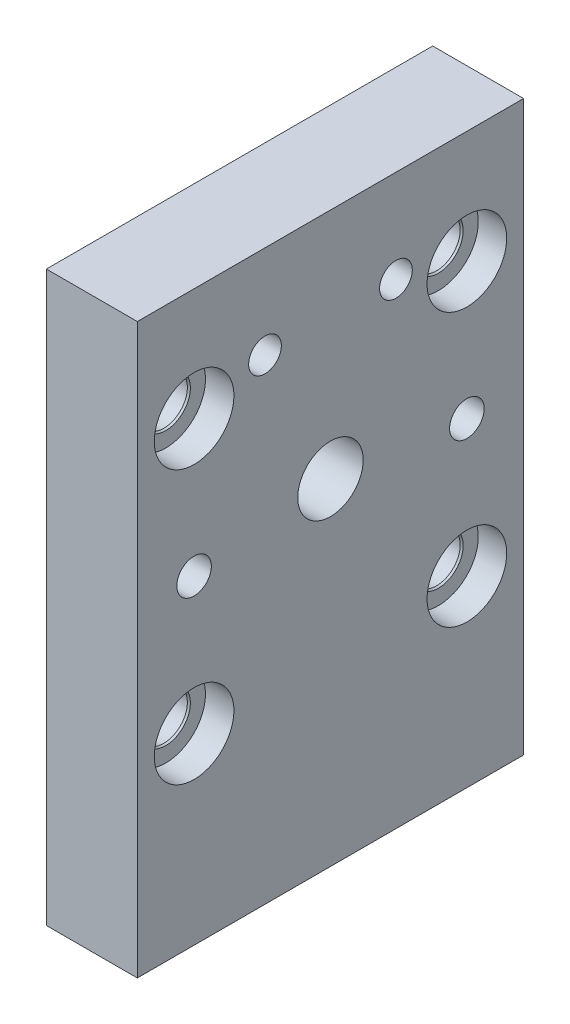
from build123d import *

# Parameters (mm, degrees)
SKETCH1_W          = 26.9748
SKETCH1_H          = 39.7002
SKETCH1_R          = 1.2065
SKETCH1_R_2        = 2.286
EXTRUDE1_DEPTH     = 6.35
SKETCH2_R          = 2.794
CUT_EXTRUDE1_DEPTH = 3.175
SKETCH3_R          = 2.794
CUT_EXTRUDE2_DEPTH = 3.175
SKETCH4_R          = 2.794
CUT_EXTRUDE3_DEPTH = 3.175
CUT_EXTRUDE4_DEPTH = 1.5875
CUT_EXTRUDE5_DEPTH = 1.5875
CUT_EXTRUDE6_DEPTH = 1.5875
SKETCH15_R         = 1.143
CUT_EXTRUDE7_DEPTH = 6.35
SKETCH16_R         = 1.143
CUT_EXTRUDE8_DEPTH = 6.35


with BuildPart() as part:
    # Sketch1 → Extrude1 (new body)
    with BuildSketch(Plane(origin=(0, 0, 0), x_dir=(0, 0, -1), z_dir=(1, 0, 0))):
        with Locations((0, 19.8501)):
            Rectangle(SKETCH1_W, SKETCH1_H)
        with Locations((9.525, 22.3266)):
            Circle(SKETCH1_R, mode=Mode.SUBTRACT)
        with Locations((0, 23.4442)):
            Circle(SKETCH1_R_2, mode=Mode.SUBTRACT)
        with Locations((-9.525, 22.3266)):
            Circle(SKETCH1_R, mode=Mode.SUBTRACT)
    extrude(amount=EXTRUDE1_DEPTH)

    # Sketch2 → Cut-Extrude1 (cut)
    with BuildSketch(Plane(origin=(0, 0, 0), x_dir=(0, 0, -1), z_dir=(1, 0, 0))):
        with Locations((0, 10.5156)):
            Circle(SKETCH2_R)
    extrude(amount=CUT_EXTRUDE1_DEPTH, mode=Mode.SUBTRACT)

    # Sketch3 → Cut-Extrude2 (cut)
    with BuildSketch(Plane(origin=(0, 0, 0), x_dir=(0, 0, -1), z_dir=(1, 0, 0))):
        with Locations((0, 29.7434)):
            Circle(SKETCH3_R)
    extrude(amount=CUT_EXTRUDE2_DEPTH, mode=Mode.SUBTRACT)

    # Sketch4 → Cut-Extrude3 (cut)
    with BuildSketch(Plane(origin=(0, 0, 0), x_dir=(0, 0, -1), z_dir=(1, 0, 0))):
        with Locations((0, 36.0934)):
            Circle(SKETCH4_R)
    extrude(amount=CUT_EXTRUDE3_DEPTH, mode=Mode.SUBTRACT)

    # Sketch5 → Revolve1 (revolve)
    with BuildSketch(Plane.XY, mode=Mode.PRIVATE) as revolve1_sk:
        with BuildLine():
            Line((0, 10.5156), (0, 12.5476))
            ThreePointArc((0, 12.5476), (0.148789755, 12.906810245), (0.508, 13.0556))
            Line((0.508, 13.0556), (3.175, 13.0556))
            Line((3.175, 13.0556), (3.175, 10.5156))
            Line((3.175, 10.5156), (0, 10.5156))
        make_face()
    revolve(revolve1_sk.sketch.rotate(Axis((3.175, 10.5156, 0), (-1, 0, 0)), 270), axis=Axis((3.175, 10.5156, 0), (-1, 0, 0)))

    # Sketch6 → Revolve2 (revolve)
    with BuildSketch(Plane.XY, mode=Mode.PRIVATE) as revolve2_sk:
        with BuildLine():
            Line((0, 36.0934), (0, 38.1254))
            ThreePointArc((0, 38.1254), (0.148789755, 38.484610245), (0.508, 38.6334))
            Line((0.508, 38.6334), (3.175, 38.6334))
            Line((3.175, 38.6334), (3.175, 36.0934))
            Line((3.175, 36.0934), (0, 36.0934))
        make_face()
    revolve(revolve2_sk.sketch.rotate(Axis((3.175, 36.0934, 0), (-1, 0, 0)), 270), axis=Axis((3.175, 36.0934, 0), (-1, 0, 0)))

    # Sketch7 → Revolve3 (revolve)
    with BuildSketch(Plane.XY, mode=Mode.PRIVATE) as revolve3_sk:
        with BuildLine():
            Line((0, 29.7434), (0, 31.7754))
            ThreePointArc((0, 31.7754), (0.148789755, 32.134610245), (0.508, 32.2834))
            Line((0.508, 32.2834), (3.175, 32.2834))
            Line((3.175, 32.2834), (3.175, 29.7434))
            Line((3.175, 29.7434), (0, 29.7434))
        make_face()
    revolve(revolve3_sk.sketch.rotate(Axis((3.175, 29.7434, 0), (-1, 0, 0)), 270), axis=Axis((3.175, 29.7434, 0), (-1, 0, 0)))

    # Sketch8 → Cut-Extrude4 (cut)
    with BuildSketch(Plane(origin=(0, 0, 0), x_dir=(0, 0, -1), z_dir=(1, 0, 0))):
        Polygon((-1.5875, 11.432143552), (-1.5875, 9.599056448), (0, 8.682512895), (1.5875, 9.599056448), (1.5875, 11.432143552), (0, 12.348687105), align=None)
    extrude(amount=CUT_EXTRUDE4_DEPTH, mode=Mode.SUBTRACT)

    # Sketch9 → Cut-Extrude5 (cut)
    with BuildSketch(Plane(origin=(0, 0, 0), x_dir=(0, 0, -1), z_dir=(1, 0, 0))):
        Polygon((-1.5875, 37.009943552), (-1.5875, 35.176856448), (0, 34.260312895), (1.5875, 35.176856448), (1.5875, 37.009943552), (0, 37.926487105), align=None)
    extrude(amount=CUT_EXTRUDE5_DEPTH, mode=Mode.SUBTRACT)

    # Sketch10 → Cut-Extrude6 (cut)
    with BuildSketch(Plane(origin=(0, 0, 0), x_dir=(0, 0, -1), z_dir=(1, 0, 0))):
        Polygon((-1.5875, 30.659943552), (-1.5875, 28.826856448), (0, 27.910312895), (1.5875, 28.826856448), (1.5875, 30.659943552), (0, 31.576487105), align=None)
    extrude(amount=CUT_EXTRUDE6_DEPTH, mode=Mode.SUBTRACT)

    # Sketch11 → Cut-Revolve1 (revolve, cut)
    with BuildSketch(Plane.XY.offset(9.525), mode=Mode.PRIVATE) as cut_revolve1_sk:
        Polygon((0, 31.8516), (0, 33.5026), (4.233333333, 33.5026), (4.365315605, 33.5788), (4.365315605, 34.6329), (6.35, 34.6329), (6.35, 31.8516), align=None)
    revolve(cut_revolve1_sk.sketch.rotate(Axis((6.35, 31.8516, 9.525), (-1, 0, 0)), 270), axis=Axis((6.35, 31.8516, 9.525), (-1, 0, 0)), mode=Mode.SUBTRACT)

    # Sketch12 → Cut-Revolve2 (revolve, cut)
    with BuildSketch(Plane.XY.offset(9.525), mode=Mode.PRIVATE) as cut_revolve2_sk:
        Polygon((0, 12.8016), (0, 14.4526), (4.233333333, 14.4526), (4.365315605, 14.5288), (4.365315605, 15.5829), (6.35, 15.5829), (6.35, 12.8016), align=None)
    revolve(cut_revolve2_sk.sketch.rotate(Axis((6.35, 12.8016, 9.525), (-1, 0, 0)), 270), axis=Axis((6.35, 12.8016, 9.525), (-1, 0, 0)), mode=Mode.SUBTRACT)

    # Sketch13 → Cut-Revolve3 (revolve, cut)
    with BuildSketch(Plane.XY.offset(-9.525), mode=Mode.PRIVATE) as cut_revolve3_sk:
        Polygon((0, 12.8016), (0, 14.4526), (4.233333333, 14.4526), (4.365315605, 14.5288), (4.365315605, 15.5829), (6.35, 15.5829), (6.35, 12.8016), align=None)
    revolve(cut_revolve3_sk.sketch.rotate(Axis((6.35, 12.8016, -9.525), (-1, 0, 0)), 270), axis=Axis((6.35, 12.8016, -9.525), (-1, 0, 0)), mode=Mode.SUBTRACT)

    # Sketch14 → Cut-Revolve4 (revolve, cut)
    with BuildSketch(Plane.XY.offset(-9.525), mode=Mode.PRIVATE) as cut_revolve4_sk:
        Polygon((0, 31.8516), (0, 33.5026), (4.233333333, 33.5026), (4.365315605, 33.5788), (4.365315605, 34.6329), (6.35, 34.6329), (6.35, 31.8516), align=None)
    revolve(cut_revolve4_sk.sketch.rotate(Axis((6.35, 31.8516, -9.525), (-1, 0, 0)), 270), axis=Axis((6.35, 31.8516, -9.525), (-1, 0, 0)), mode=Mode.SUBTRACT)

    # Sketch15 → Cut-Extrude7 (cut)
    with BuildSketch(Plane(origin=(0, 0, 0), x_dir=(0, 0, -1), z_dir=(1, 0, 0))):
        with Locations((4.572, 33.2232)):
            Circle(SKETCH15_R)
    extrude(amount=CUT_EXTRUDE7_DEPTH, mode=Mode.SUBTRACT)

    # Sketch16 → Cut-Extrude8 (cut)
    with BuildSketch(Plane(origin=(0, 0, 0), x_dir=(0, 0, -1), z_dir=(1, 0, 0))):
        with Locations((-4.572, 33.2232)):
            Circle(SKETCH16_R)
    extrude(amount=CUT_EXTRUDE8_DEPTH, mode=Mode.SUBTRACT)


solid = part.part
